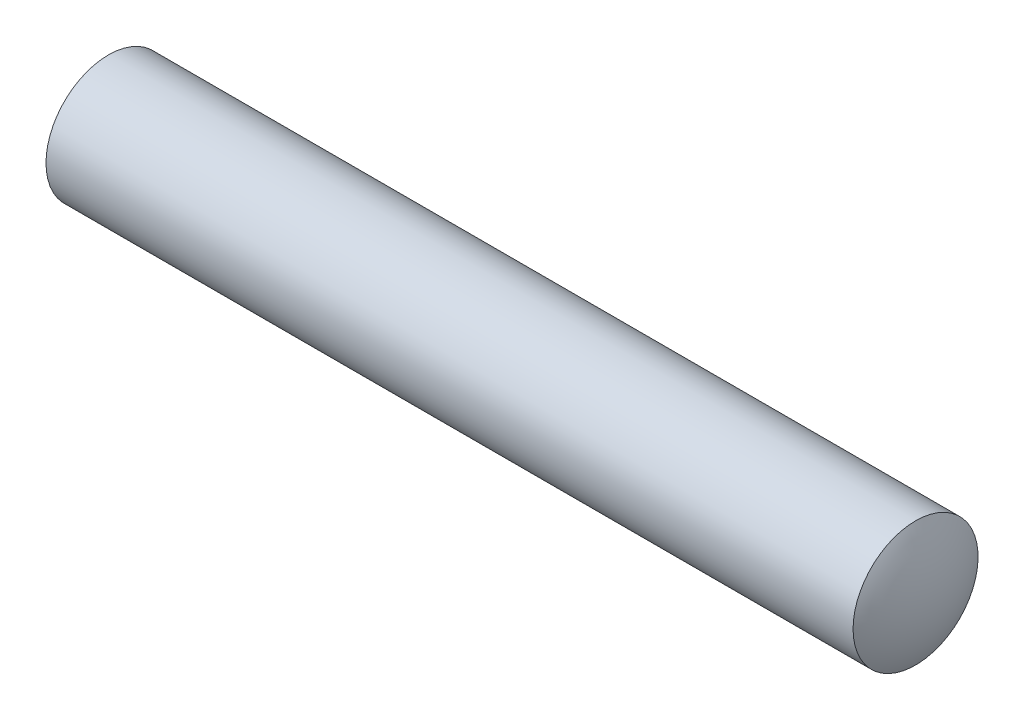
ISO-10303-21;
HEADER;
FILE_DESCRIPTION(('STEP AP214'),'2;1');
FILE_NAME('part.step','',(''),(''),'','','');
FILE_SCHEMA(('AUTOMOTIVE_DESIGN { 1 0 10303 214 1 1 1 1 }'));
ENDSEC;
DATA;
#1=APPLICATION_CONTEXT('core data for automotive mechanical design processes');
#2=APPLICATION_PROTOCOL_DEFINITION('international standard','automotive_design',2000,#1);
#3=PRODUCT_CONTEXT('',#1,'mechanical');
#4=PRODUCT('Part','Part','',(#3));
#5=PRODUCT_RELATED_PRODUCT_CATEGORY('part','',(#4));
#6=PRODUCT_DEFINITION_FORMATION('','',#4);
#7=PRODUCT_DEFINITION_CONTEXT('part definition',#1,'design');
#8=PRODUCT_DEFINITION('design','',#6,#7);
#9=PRODUCT_DEFINITION_SHAPE('','',#8);
#10=(LENGTH_UNIT() NAMED_UNIT(*) SI_UNIT(.MILLI.,.METRE.));
#11=(NAMED_UNIT(*) PLANE_ANGLE_UNIT() SI_UNIT($,.RADIAN.));
#12=(NAMED_UNIT(*) SI_UNIT($,.STERADIAN.) SOLID_ANGLE_UNIT());
#13=UNCERTAINTY_MEASURE_WITH_UNIT(LENGTH_MEASURE(1.E-05),#10,'distance_accuracy_value','');
#14=(GEOMETRIC_REPRESENTATION_CONTEXT(3) GLOBAL_UNCERTAINTY_ASSIGNED_CONTEXT((#13)) GLOBAL_UNIT_ASSIGNED_CONTEXT((#10,
#11,#12)) REPRESENTATION_CONTEXT('',''));
#15=CARTESIAN_POINT('',(0.,0.,0.));
#16=DIRECTION('',(0.,0.,1.));
#17=DIRECTION('',(1.,0.,0.));
#18=AXIS2_PLACEMENT_3D('',#15,#16,#17);
#19=CARTESIAN_POINT('',(6.,0.,0.));
#20=DIRECTION('',(-1.,0.,0.));
#21=DIRECTION('',(0.,1.,0.));
#22=AXIS2_PLACEMENT_3D('',#19,#20,#21);
#23=SPHERICAL_SURFACE('',#22,6.);
#24=CARTESIAN_POINT('',(0.789493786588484,0.,0.));
#25=DIRECTION('',(-1.,0.,0.));
#26=DIRECTION('',(0.,0.,1.));
#27=AXIS2_PLACEMENT_3D('',#24,#25,#26);
#28=CIRCLE('',#27,2.975);
#29=CARTESIAN_POINT('',(0.789493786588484,0.,2.975));
#30=VERTEX_POINT('',#29);
#31=EDGE_CURVE('E38',#30,#30,#28,.T.);
#32=ORIENTED_EDGE('',*,*,#31,.T.);
#33=EDGE_LOOP('',(#32));
#34=FACE_BOUND('',#33,.T.);
#35=ADVANCED_FACE('F32',(#34),#23,.T.);
#36=CARTESIAN_POINT('',(34.,0.,0.));
#37=DIRECTION('',(-1.,0.,0.));
#38=DIRECTION('',(0.,1.,0.));
#39=AXIS2_PLACEMENT_3D('',#36,#37,#38);
#40=SPHERICAL_SURFACE('',#39,6.);
#41=CARTESIAN_POINT('',(39.2105062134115,0.,0.));
#42=DIRECTION('',(-1.,0.,0.));
#43=DIRECTION('',(0.,0.,1.));
#44=AXIS2_PLACEMENT_3D('',#41,#42,#43);
#45=CIRCLE('',#44,2.975);
#46=CARTESIAN_POINT('',(39.2105062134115,0.,2.975));
#47=VERTEX_POINT('',#46);
#48=EDGE_CURVE('E10',#47,#47,#45,.T.);
#49=ORIENTED_EDGE('',*,*,#48,.F.);
#50=EDGE_LOOP('',(#49));
#51=FACE_BOUND('',#50,.T.);
#52=ADVANCED_FACE('F47',(#51),#40,.T.);
#53=CARTESIAN_POINT('',(18.,0.,0.));
#54=DIRECTION('',(-1.,0.,0.));
#55=DIRECTION('',(0.,0.,1.));
#56=AXIS2_PLACEMENT_3D('',#53,#54,#55);
#57=CYLINDRICAL_SURFACE('',#56,2.975);
#58=ORIENTED_EDGE('',*,*,#31,.F.);
#59=EDGE_LOOP('',(#58));
#60=FACE_BOUND('',#59,.T.);
#61=ORIENTED_EDGE('',*,*,#48,.T.);
#62=EDGE_LOOP('',(#61));
#63=FACE_BOUND('',#62,.T.);
#64=ADVANCED_FACE('F45',(#60,#63),#57,.T.);
#65=CLOSED_SHELL('',(#35,#52,#64));
#66=MANIFOLD_SOLID_BREP('B2',#65);
#67=ADVANCED_BREP_SHAPE_REPRESENTATION('',(#18,#66),#14);
#68=SHAPE_DEFINITION_REPRESENTATION(#9,#67);
ENDSEC;
END-ISO-10303-21;
